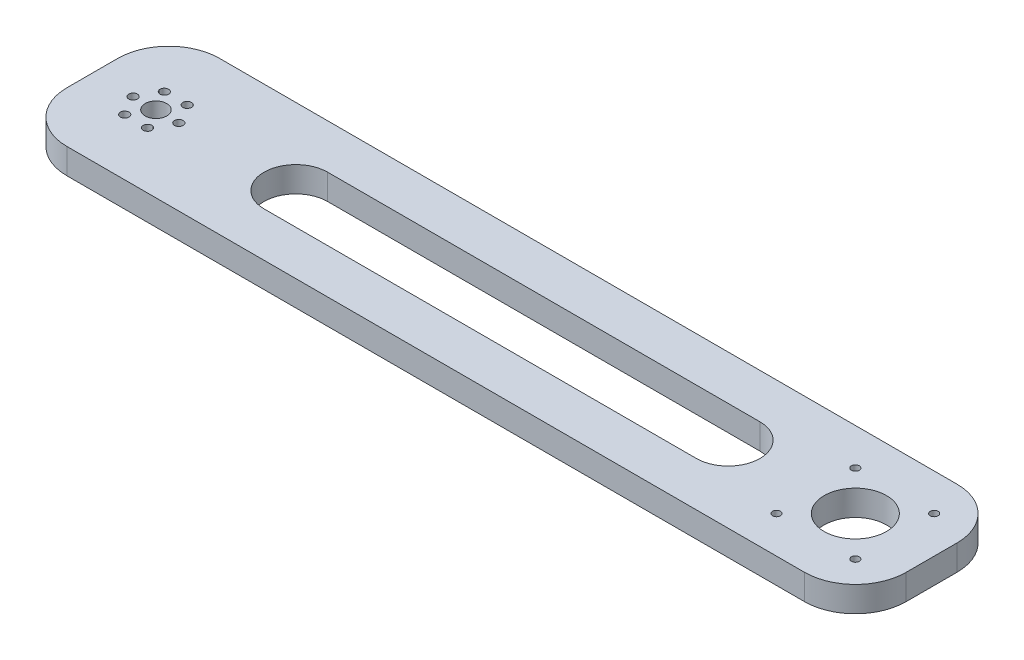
ISO-10303-21;
HEADER;
FILE_DESCRIPTION(('STEP AP214'),'2;1');
FILE_NAME('part.step','',(''),(''),'','','');
FILE_SCHEMA(('AUTOMOTIVE_DESIGN { 1 0 10303 214 1 1 1 1 }'));
ENDSEC;
DATA;
#1=APPLICATION_CONTEXT('core data for automotive mechanical design processes');
#2=APPLICATION_PROTOCOL_DEFINITION('international standard','automotive_design',2000,#1);
#3=PRODUCT_CONTEXT('',#1,'mechanical');
#4=PRODUCT('Part','Part','',(#3));
#5=PRODUCT_RELATED_PRODUCT_CATEGORY('part','',(#4));
#6=PRODUCT_DEFINITION_FORMATION('','',#4);
#7=PRODUCT_DEFINITION_CONTEXT('part definition',#1,'design');
#8=PRODUCT_DEFINITION('design','',#6,#7);
#9=PRODUCT_DEFINITION_SHAPE('','',#8);
#10=(LENGTH_UNIT() NAMED_UNIT(*) SI_UNIT(.MILLI.,.METRE.));
#11=(NAMED_UNIT(*) PLANE_ANGLE_UNIT() SI_UNIT($,.RADIAN.));
#12=(NAMED_UNIT(*) SI_UNIT($,.STERADIAN.) SOLID_ANGLE_UNIT());
#13=UNCERTAINTY_MEASURE_WITH_UNIT(LENGTH_MEASURE(1.E-05),#10,'distance_accuracy_value','');
#14=(GEOMETRIC_REPRESENTATION_CONTEXT(3) GLOBAL_UNCERTAINTY_ASSIGNED_CONTEXT((#13)) GLOBAL_UNIT_ASSIGNED_CONTEXT((#10,
#11,#12)) REPRESENTATION_CONTEXT('',''));
#15=CARTESIAN_POINT('',(0.,0.,0.));
#16=DIRECTION('',(0.,0.,1.));
#17=DIRECTION('',(1.,0.,0.));
#18=AXIS2_PLACEMENT_3D('',#15,#16,#17);
#19=CARTESIAN_POINT('',(165.,10.,30.));
#20=DIRECTION('',(-1.,0.,0.));
#21=DIRECTION('',(0.,0.,1.));
#22=AXIS2_PLACEMENT_3D('',#19,#20,#21);
#23=PLANE('',#22);
#24=DIRECTION('',(0.,0.,-1.));
#25=VECTOR('',#24,1.);
#26=CARTESIAN_POINT('',(165.,10.,30.));
#27=LINE('',#26,#25);
#28=CARTESIAN_POINT('',(165.,10.,9.99999999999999));
#29=VERTEX_POINT('',#28);
#30=CARTESIAN_POINT('',(165.,10.,-10.));
#31=VERTEX_POINT('',#30);
#32=EDGE_CURVE('E207',#29,#31,#27,.T.);
#33=ORIENTED_EDGE('',*,*,#32,.F.);
#34=DIRECTION('',(0.,-1.,0.));
#35=VECTOR('',#34,1.);
#36=CARTESIAN_POINT('',(165.,10.,9.99999999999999));
#37=LINE('',#36,#35);
#38=CARTESIAN_POINT('',(165.,0.,9.99999999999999));
#39=VERTEX_POINT('',#38);
#40=EDGE_CURVE('E235',#29,#39,#37,.T.);
#41=ORIENTED_EDGE('',*,*,#40,.T.);
#42=DIRECTION('',(0.,0.,-1.));
#43=VECTOR('',#42,1.);
#44=CARTESIAN_POINT('',(165.,0.,30.));
#45=LINE('',#44,#43);
#46=CARTESIAN_POINT('',(165.,0.,-10.));
#47=VERTEX_POINT('',#46);
#48=EDGE_CURVE('E218',#39,#47,#45,.T.);
#49=ORIENTED_EDGE('',*,*,#48,.T.);
#50=DIRECTION('',(0.,-1.,0.));
#51=VECTOR('',#50,1.);
#52=CARTESIAN_POINT('',(165.,10.,-10.));
#53=LINE('',#52,#51);
#54=EDGE_CURVE('E216',#47,#31,#53,.F.);
#55=ORIENTED_EDGE('',*,*,#54,.T.);
#56=EDGE_LOOP('',(#33,#41,#49,#55));
#57=FACE_BOUND('',#56,.T.);
#58=ADVANCED_FACE('F43',(#57),#23,.F.);
#59=CARTESIAN_POINT('',(-165.,10.,-30.));
#60=DIRECTION('',(0.,0.,1.));
#61=DIRECTION('',(1.,0.,0.));
#62=AXIS2_PLACEMENT_3D('',#59,#60,#61);
#63=PLANE('',#62);
#64=DIRECTION('',(-1.,0.,0.));
#65=VECTOR('',#64,1.);
#66=CARTESIAN_POINT('',(-165.,10.,-30.));
#67=LINE('',#66,#65);
#68=CARTESIAN_POINT('',(145.,10.,-30.));
#69=VERTEX_POINT('',#68);
#70=CARTESIAN_POINT('',(-145.,10.,-30.));
#71=VERTEX_POINT('',#70);
#72=EDGE_CURVE('E206',#69,#71,#67,.T.);
#73=ORIENTED_EDGE('',*,*,#72,.F.);
#74=DIRECTION('',(0.,-1.,0.));
#75=VECTOR('',#74,1.);
#76=CARTESIAN_POINT('',(145.,10.,-30.));
#77=LINE('',#76,#75);
#78=CARTESIAN_POINT('',(145.,0.,-30.));
#79=VERTEX_POINT('',#78);
#80=EDGE_CURVE('E256',#69,#79,#77,.T.);
#81=ORIENTED_EDGE('',*,*,#80,.T.);
#82=DIRECTION('',(-1.,0.,0.));
#83=VECTOR('',#82,1.);
#84=CARTESIAN_POINT('',(-165.,0.,-30.));
#85=LINE('',#84,#83);
#86=CARTESIAN_POINT('',(-145.,0.,-30.));
#87=VERTEX_POINT('',#86);
#88=EDGE_CURVE('E224',#79,#87,#85,.T.);
#89=ORIENTED_EDGE('',*,*,#88,.T.);
#90=DIRECTION('',(0.,-1.,0.));
#91=VECTOR('',#90,1.);
#92=CARTESIAN_POINT('',(-145.,10.,-30.));
#93=LINE('',#92,#91);
#94=EDGE_CURVE('E258',#87,#71,#93,.F.);
#95=ORIENTED_EDGE('',*,*,#94,.T.);
#96=EDGE_LOOP('',(#73,#81,#89,#95));
#97=FACE_BOUND('',#96,.T.);
#98=ADVANCED_FACE('F291',(#97),#63,.F.);
#99=CARTESIAN_POINT('',(-165.,10.,30.));
#100=DIRECTION('',(1.,0.,0.));
#101=DIRECTION('',(0.,0.,-1.));
#102=AXIS2_PLACEMENT_3D('',#99,#100,#101);
#103=PLANE('',#102);
#104=DIRECTION('',(0.,0.,1.));
#105=VECTOR('',#104,1.);
#106=CARTESIAN_POINT('',(-165.,10.,30.));
#107=LINE('',#106,#105);
#108=CARTESIAN_POINT('',(-165.,10.,-10.));
#109=VERTEX_POINT('',#108);
#110=CARTESIAN_POINT('',(-165.,10.,9.99999999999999));
#111=VERTEX_POINT('',#110);
#112=EDGE_CURVE('E214',#109,#111,#107,.T.);
#113=ORIENTED_EDGE('',*,*,#112,.F.);
#114=DIRECTION('',(0.,-1.,0.));
#115=VECTOR('',#114,1.);
#116=CARTESIAN_POINT('',(-165.,10.,-10.));
#117=LINE('',#116,#115);
#118=CARTESIAN_POINT('',(-165.,0.,-10.));
#119=VERTEX_POINT('',#118);
#120=EDGE_CURVE('E11',#109,#119,#117,.T.);
#121=ORIENTED_EDGE('',*,*,#120,.T.);
#122=DIRECTION('',(0.,0.,1.));
#123=VECTOR('',#122,1.);
#124=CARTESIAN_POINT('',(-165.,0.,30.));
#125=LINE('',#124,#123);
#126=CARTESIAN_POINT('',(-165.,0.,9.99999999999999));
#127=VERTEX_POINT('',#126);
#128=EDGE_CURVE('E229',#119,#127,#125,.T.);
#129=ORIENTED_EDGE('',*,*,#128,.T.);
#130=DIRECTION('',(0.,-1.,0.));
#131=VECTOR('',#130,1.);
#132=CARTESIAN_POINT('',(-165.,10.,9.99999999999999));
#133=LINE('',#132,#131);
#134=EDGE_CURVE('E55',#127,#111,#133,.F.);
#135=ORIENTED_EDGE('',*,*,#134,.T.);
#136=EDGE_LOOP('',(#113,#121,#129,#135));
#137=FACE_BOUND('',#136,.T.);
#138=ADVANCED_FACE('F264',(#137),#103,.F.);
#139=CARTESIAN_POINT('',(-165.,10.,30.));
#140=DIRECTION('',(0.,0.,-1.));
#141=DIRECTION('',(-1.,0.,0.));
#142=AXIS2_PLACEMENT_3D('',#139,#140,#141);
#143=PLANE('',#142);
#144=DIRECTION('',(1.,0.,0.));
#145=VECTOR('',#144,1.);
#146=CARTESIAN_POINT('',(-165.,0.,30.));
#147=LINE('',#146,#145);
#148=CARTESIAN_POINT('',(-145.,0.,30.));
#149=VERTEX_POINT('',#148);
#150=CARTESIAN_POINT('',(145.,0.,30.));
#151=VERTEX_POINT('',#150);
#152=EDGE_CURVE('E208',#149,#151,#147,.T.);
#153=ORIENTED_EDGE('',*,*,#152,.T.);
#154=DIRECTION('',(0.,-1.,0.));
#155=VECTOR('',#154,1.);
#156=CARTESIAN_POINT('',(145.,10.,30.));
#157=LINE('',#156,#155);
#158=CARTESIAN_POINT('',(145.,10.,30.));
#159=VERTEX_POINT('',#158);
#160=EDGE_CURVE('E246',#151,#159,#157,.F.);
#161=ORIENTED_EDGE('',*,*,#160,.T.);
#162=DIRECTION('',(1.,0.,0.));
#163=VECTOR('',#162,1.);
#164=CARTESIAN_POINT('',(-165.,10.,30.));
#165=LINE('',#164,#163);
#166=CARTESIAN_POINT('',(-145.,10.,30.));
#167=VERTEX_POINT('',#166);
#168=EDGE_CURVE('E217',#167,#159,#165,.T.);
#169=ORIENTED_EDGE('',*,*,#168,.F.);
#170=DIRECTION('',(0.,-1.,0.));
#171=VECTOR('',#170,1.);
#172=CARTESIAN_POINT('',(-145.,10.,30.));
#173=LINE('',#172,#171);
#174=EDGE_CURVE('E244',#167,#149,#173,.T.);
#175=ORIENTED_EDGE('',*,*,#174,.T.);
#176=EDGE_LOOP('',(#153,#161,#169,#175));
#177=FACE_BOUND('',#176,.T.);
#178=ADVANCED_FACE('F274',(#177),#143,.F.);
#179=CARTESIAN_POINT('',(0.,10.,0.));
#180=DIRECTION('',(0.,-1.,0.));
#181=DIRECTION('',(0.,0.,-1.));
#182=AXIS2_PLACEMENT_3D('',#179,#180,#181);
#183=PLANE('',#182);
#184=CARTESIAN_POINT('',(-144.5,10.,7.7942286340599));
#185=DIRECTION('',(0.,-1.,0.));
#186=DIRECTION('',(-0.866025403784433,0.,-0.50000000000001));
#187=AXIS2_PLACEMENT_3D('',#184,#185,#186);
#188=CIRCLE('',#187,1.70000000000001);
#189=CARTESIAN_POINT('',(-145.972243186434,10.,6.94422863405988));
#190=VERTEX_POINT('',#189);
#191=EDGE_CURVE('E542',#190,#190,#188,.T.);
#192=ORIENTED_EDGE('',*,*,#191,.T.);
#193=EDGE_LOOP('',(#192));
#194=FACE_BOUND('',#193,.T.);
#195=CARTESIAN_POINT('',(-135.5,10.,7.79422863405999));
#196=DIRECTION('',(0.,-1.,0.));
#197=DIRECTION('',(-0.866025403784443,0.,0.499999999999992));
#198=AXIS2_PLACEMENT_3D('',#195,#196,#197);
#199=CIRCLE('',#198,1.70000000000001);
#200=CARTESIAN_POINT('',(-136.972243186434,10.,8.64422863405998));
#201=VERTEX_POINT('',#200);
#202=EDGE_CURVE('E601',#201,#201,#199,.T.);
#203=ORIENTED_EDGE('',*,*,#202,.T.);
#204=EDGE_LOOP('',(#203));
#205=FACE_BOUND('',#204,.T.);
#206=CARTESIAN_POINT('',(-131.,10.,0.));
#207=DIRECTION('',(0.,-1.,0.));
#208=DIRECTION('',(0.,0.,1.));
#209=AXIS2_PLACEMENT_3D('',#206,#207,#208);
#210=CIRCLE('',#209,1.70000000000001);
#211=CARTESIAN_POINT('',(-131.,10.,1.70000000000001));
#212=VERTEX_POINT('',#211);
#213=EDGE_CURVE('E591',#212,#212,#210,.T.);
#214=ORIENTED_EDGE('',*,*,#213,.T.);
#215=EDGE_LOOP('',(#214));
#216=FACE_BOUND('',#215,.T.);
#217=CARTESIAN_POINT('',(-135.5,10.,-7.79422863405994));
#218=DIRECTION('',(0.,-1.,0.));
#219=DIRECTION('',(0.866025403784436,0.,0.500000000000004));
#220=AXIS2_PLACEMENT_3D('',#217,#218,#219);
#221=CIRCLE('',#220,1.70000000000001);
#222=CARTESIAN_POINT('',(-134.027756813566,10.,-6.94422863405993));
#223=VERTEX_POINT('',#222);
#224=EDGE_CURVE('E553',#223,#223,#221,.T.);
#225=ORIENTED_EDGE('',*,*,#224,.T.);
#226=EDGE_LOOP('',(#225));
#227=FACE_BOUND('',#226,.T.);
#228=CARTESIAN_POINT('',(-144.5,10.,-7.79422863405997));
#229=DIRECTION('',(0.,-1.,0.));
#230=DIRECTION('',(0.86602540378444,0.,-0.499999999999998));
#231=AXIS2_PLACEMENT_3D('',#228,#229,#230);
#232=CIRCLE('',#231,1.70000000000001);
#233=CARTESIAN_POINT('',(-143.027756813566,10.,-8.64422863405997));
#234=VERTEX_POINT('',#233);
#235=EDGE_CURVE('E548',#234,#234,#232,.T.);
#236=ORIENTED_EDGE('',*,*,#235,.T.);
#237=EDGE_LOOP('',(#236));
#238=FACE_BOUND('',#237,.T.);
#239=CARTESIAN_POINT('',(-149.,10.,0.));
#240=DIRECTION('',(0.,-1.,0.));
#241=DIRECTION('',(0.,0.,-1.));
#242=AXIS2_PLACEMENT_3D('',#239,#240,#241);
#243=CIRCLE('',#242,1.70000000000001);
#244=CARTESIAN_POINT('',(-149.,10.,-1.70000000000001));
#245=VERTEX_POINT('',#244);
#246=EDGE_CURVE('E161',#245,#245,#243,.T.);
#247=ORIENTED_EDGE('',*,*,#246,.T.);
#248=EDGE_LOOP('',(#247));
#249=FACE_BOUND('',#248,.T.);
#250=DIRECTION('',(-1.,0.,0.));
#251=VECTOR('',#250,1.);
#252=CARTESIAN_POINT('',(-85.,10.,12.5));
#253=LINE('',#252,#251);
#254=CARTESIAN_POINT('',(85.,10.,12.5));
#255=VERTEX_POINT('',#254);
#256=CARTESIAN_POINT('',(-85.,10.,12.5));
#257=VERTEX_POINT('',#256);
#258=EDGE_CURVE('E142',#255,#257,#253,.T.);
#259=ORIENTED_EDGE('',*,*,#258,.T.);
#260=CARTESIAN_POINT('',(-85.,10.,0.));
#261=DIRECTION('',(0.,-1.,0.));
#262=DIRECTION('',(0.,0.,-1.));
#263=AXIS2_PLACEMENT_3D('',#260,#261,#262);
#264=CIRCLE('',#263,12.5);
#265=CARTESIAN_POINT('',(-85.,10.,-12.5));
#266=VERTEX_POINT('',#265);
#267=EDGE_CURVE('E133',#257,#266,#264,.T.);
#268=ORIENTED_EDGE('',*,*,#267,.T.);
#269=DIRECTION('',(1.,0.,0.));
#270=VECTOR('',#269,1.);
#271=CARTESIAN_POINT('',(-85.,10.,-12.5));
#272=LINE('',#271,#270);
#273=CARTESIAN_POINT('',(85.,10.,-12.5));
#274=VERTEX_POINT('',#273);
#275=EDGE_CURVE('E141',#266,#274,#272,.T.);
#276=ORIENTED_EDGE('',*,*,#275,.T.);
#277=CARTESIAN_POINT('',(85.,10.,0.));
#278=DIRECTION('',(0.,-1.,0.));
#279=DIRECTION('',(0.,0.,-1.));
#280=AXIS2_PLACEMENT_3D('',#277,#278,#279);
#281=CIRCLE('',#280,12.5);
#282=EDGE_CURVE('E56',#274,#255,#281,.T.);
#283=ORIENTED_EDGE('',*,*,#282,.T.);
#284=EDGE_LOOP('',(#259,#268,#276,#283));
#285=FACE_BOUND('',#284,.T.);
#286=CARTESIAN_POINT('',(-140.,10.,0.));
#287=DIRECTION('',(0.,-1.,0.));
#288=DIRECTION('',(0.,0.,-1.));
#289=AXIS2_PLACEMENT_3D('',#286,#287,#288);
#290=CIRCLE('',#289,4.25000000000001);
#291=CARTESIAN_POINT('',(-140.,10.,-4.25000000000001));
#292=VERTEX_POINT('',#291);
#293=EDGE_CURVE('E173',#292,#292,#290,.T.);
#294=ORIENTED_EDGE('',*,*,#293,.T.);
#295=EDGE_LOOP('',(#294));
#296=FACE_BOUND('',#295,.T.);
#297=CARTESIAN_POINT('',(119.5,10.,-15.5));
#298=DIRECTION('',(0.,-1.,0.));
#299=DIRECTION('',(0.,0.,-1.));
#300=AXIS2_PLACEMENT_3D('',#297,#298,#299);
#301=CIRCLE('',#300,1.54999999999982);
#302=CARTESIAN_POINT('',(119.5,10.,-17.0499999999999));
#303=VERTEX_POINT('',#302);
#304=EDGE_CURVE('E176',#303,#303,#301,.T.);
#305=ORIENTED_EDGE('',*,*,#304,.T.);
#306=EDGE_LOOP('',(#305));
#307=FACE_BOUND('',#306,.T.);
#308=CARTESIAN_POINT('',(150.5,10.,-15.5));
#309=DIRECTION('',(0.,-1.,0.));
#310=DIRECTION('',(0.,0.,-1.));
#311=AXIS2_PLACEMENT_3D('',#308,#309,#310);
#312=CIRCLE('',#311,1.54999999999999);
#313=CARTESIAN_POINT('',(150.5,10.,-17.05));
#314=VERTEX_POINT('',#313);
#315=EDGE_CURVE('E187',#314,#314,#312,.T.);
#316=ORIENTED_EDGE('',*,*,#315,.T.);
#317=EDGE_LOOP('',(#316));
#318=FACE_BOUND('',#317,.T.);
#319=CARTESIAN_POINT('',(150.5,10.,15.5));
#320=DIRECTION('',(0.,-1.,0.));
#321=DIRECTION('',(0.,0.,-1.));
#322=AXIS2_PLACEMENT_3D('',#319,#320,#321);
#323=CIRCLE('',#322,1.54999999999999);
#324=CARTESIAN_POINT('',(150.5,10.,13.95));
#325=VERTEX_POINT('',#324);
#326=EDGE_CURVE('E185',#325,#325,#323,.T.);
#327=ORIENTED_EDGE('',*,*,#326,.T.);
#328=EDGE_LOOP('',(#327));
#329=FACE_BOUND('',#328,.T.);
#330=CARTESIAN_POINT('',(119.5,10.,15.5));
#331=DIRECTION('',(0.,-1.,0.));
#332=DIRECTION('',(0.,0.,-1.));
#333=AXIS2_PLACEMENT_3D('',#330,#331,#332);
#334=CIRCLE('',#333,1.54999999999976);
#335=CARTESIAN_POINT('',(119.5,10.,13.9500000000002));
#336=VERTEX_POINT('',#335);
#337=EDGE_CURVE('E198',#336,#336,#334,.T.);
#338=ORIENTED_EDGE('',*,*,#337,.T.);
#339=EDGE_LOOP('',(#338));
#340=FACE_BOUND('',#339,.T.);
#341=CARTESIAN_POINT('',(135.,10.,0.));
#342=DIRECTION('',(0.,1.,0.));
#343=DIRECTION('',(0.,0.,1.));
#344=AXIS2_PLACEMENT_3D('',#341,#342,#343);
#345=CIRCLE('',#344,12.25);
#346=CARTESIAN_POINT('',(135.,10.,12.25));
#347=VERTEX_POINT('',#346);
#348=EDGE_CURVE('E201',#347,#347,#345,.T.);
#349=ORIENTED_EDGE('',*,*,#348,.F.);
#350=EDGE_LOOP('',(#349));
#351=FACE_BOUND('',#350,.T.);
#352=ORIENTED_EDGE('',*,*,#168,.T.);
#353=CARTESIAN_POINT('',(145.,10.,9.99999999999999));
#354=DIRECTION('',(0.,-1.,0.));
#355=DIRECTION('',(0.,0.,-1.));
#356=AXIS2_PLACEMENT_3D('',#353,#354,#355);
#357=CIRCLE('',#356,20.);
#358=EDGE_CURVE('E253',#159,#29,#357,.F.);
#359=ORIENTED_EDGE('',*,*,#358,.T.);
#360=ORIENTED_EDGE('',*,*,#32,.T.);
#361=CARTESIAN_POINT('',(145.,10.,-10.));
#362=DIRECTION('',(0.,-1.,0.));
#363=DIRECTION('',(0.,0.,-1.));
#364=AXIS2_PLACEMENT_3D('',#361,#362,#363);
#365=CIRCLE('',#364,20.);
#366=EDGE_CURVE('E251',#31,#69,#365,.F.);
#367=ORIENTED_EDGE('',*,*,#366,.T.);
#368=ORIENTED_EDGE('',*,*,#72,.T.);
#369=CARTESIAN_POINT('',(-145.,10.,-10.));
#370=DIRECTION('',(0.,-1.,0.));
#371=DIRECTION('',(0.,0.,-1.));
#372=AXIS2_PLACEMENT_3D('',#369,#370,#371);
#373=CIRCLE('',#372,20.);
#374=EDGE_CURVE('E250',#71,#109,#373,.F.);
#375=ORIENTED_EDGE('',*,*,#374,.T.);
#376=ORIENTED_EDGE('',*,*,#112,.T.);
#377=CARTESIAN_POINT('',(-145.,10.,9.99999999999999));
#378=DIRECTION('',(0.,-1.,0.));
#379=DIRECTION('',(0.,0.,-1.));
#380=AXIS2_PLACEMENT_3D('',#377,#378,#379);
#381=CIRCLE('',#380,20.);
#382=EDGE_CURVE('E249',#111,#167,#381,.F.);
#383=ORIENTED_EDGE('',*,*,#382,.T.);
#384=EDGE_LOOP('',(#352,#359,#360,#367,#368,#375,#376,#383));
#385=FACE_BOUND('',#384,.T.);
#386=ADVANCED_FACE('F149',(#194,#205,#216,#227,#238,#249,#285,#296,#307,#318,#329,#340,#351,
#385),#183,.F.);
#387=CARTESIAN_POINT('',(0.,0.,0.));
#388=DIRECTION('',(0.,-1.,0.));
#389=DIRECTION('',(0.,0.,-1.));
#390=AXIS2_PLACEMENT_3D('',#387,#388,#389);
#391=PLANE('',#390);
#392=CARTESIAN_POINT('',(-144.5,0.,7.7942286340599));
#393=DIRECTION('',(0.,-1.,0.));
#394=DIRECTION('',(-0.866025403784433,0.,-0.50000000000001));
#395=AXIS2_PLACEMENT_3D('',#392,#393,#394);
#396=CIRCLE('',#395,1.70000000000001);
#397=CARTESIAN_POINT('',(-145.972243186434,0.,6.94422863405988));
#398=VERTEX_POINT('',#397);
#399=EDGE_CURVE('E544',#398,#398,#396,.T.);
#400=ORIENTED_EDGE('',*,*,#399,.F.);
#401=EDGE_LOOP('',(#400));
#402=FACE_BOUND('',#401,.T.);
#403=CARTESIAN_POINT('',(-135.5,0.,7.79422863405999));
#404=DIRECTION('',(0.,-1.,0.));
#405=DIRECTION('',(-0.866025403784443,0.,0.499999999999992));
#406=AXIS2_PLACEMENT_3D('',#403,#404,#405);
#407=CIRCLE('',#406,1.70000000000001);
#408=CARTESIAN_POINT('',(-136.972243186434,0.,8.64422863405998));
#409=VERTEX_POINT('',#408);
#410=EDGE_CURVE('E543',#409,#409,#407,.T.);
#411=ORIENTED_EDGE('',*,*,#410,.F.);
#412=EDGE_LOOP('',(#411));
#413=FACE_BOUND('',#412,.T.);
#414=CARTESIAN_POINT('',(-131.,0.,0.));
#415=DIRECTION('',(0.,-1.,0.));
#416=DIRECTION('',(0.,0.,1.));
#417=AXIS2_PLACEMENT_3D('',#414,#415,#416);
#418=CIRCLE('',#417,1.70000000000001);
#419=CARTESIAN_POINT('',(-131.,0.,1.70000000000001));
#420=VERTEX_POINT('',#419);
#421=EDGE_CURVE('E598',#420,#420,#418,.T.);
#422=ORIENTED_EDGE('',*,*,#421,.F.);
#423=EDGE_LOOP('',(#422));
#424=FACE_BOUND('',#423,.T.);
#425=CARTESIAN_POINT('',(-135.5,0.,-7.79422863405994));
#426=DIRECTION('',(0.,-1.,0.));
#427=DIRECTION('',(0.866025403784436,0.,0.500000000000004));
#428=AXIS2_PLACEMENT_3D('',#425,#426,#427);
#429=CIRCLE('',#428,1.70000000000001);
#430=CARTESIAN_POINT('',(-134.027756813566,0.,-6.94422863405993));
#431=VERTEX_POINT('',#430);
#432=EDGE_CURVE('E586',#431,#431,#429,.T.);
#433=ORIENTED_EDGE('',*,*,#432,.F.);
#434=EDGE_LOOP('',(#433));
#435=FACE_BOUND('',#434,.T.);
#436=CARTESIAN_POINT('',(-144.5,0.,-7.79422863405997));
#437=DIRECTION('',(0.,-1.,0.));
#438=DIRECTION('',(0.86602540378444,0.,-0.499999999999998));
#439=AXIS2_PLACEMENT_3D('',#436,#437,#438);
#440=CIRCLE('',#439,1.70000000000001);
#441=CARTESIAN_POINT('',(-143.027756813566,0.,-8.64422863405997));
#442=VERTEX_POINT('',#441);
#443=EDGE_CURVE('E551',#442,#442,#440,.T.);
#444=ORIENTED_EDGE('',*,*,#443,.F.);
#445=EDGE_LOOP('',(#444));
#446=FACE_BOUND('',#445,.T.);
#447=CARTESIAN_POINT('',(-149.,0.,0.));
#448=DIRECTION('',(0.,-1.,0.));
#449=DIRECTION('',(0.,0.,-1.));
#450=AXIS2_PLACEMENT_3D('',#447,#448,#449);
#451=CIRCLE('',#450,1.70000000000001);
#452=CARTESIAN_POINT('',(-149.,0.,-1.70000000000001));
#453=VERTEX_POINT('',#452);
#454=EDGE_CURVE('E160',#453,#453,#451,.T.);
#455=ORIENTED_EDGE('',*,*,#454,.F.);
#456=EDGE_LOOP('',(#455));
#457=FACE_BOUND('',#456,.T.);
#458=CARTESIAN_POINT('',(-85.,0.,0.));
#459=DIRECTION('',(0.,-1.,0.));
#460=DIRECTION('',(0.,0.,-1.));
#461=AXIS2_PLACEMENT_3D('',#458,#459,#460);
#462=CIRCLE('',#461,12.5);
#463=CARTESIAN_POINT('',(-85.,0.,12.5));
#464=VERTEX_POINT('',#463);
#465=CARTESIAN_POINT('',(-85.,0.,-12.5));
#466=VERTEX_POINT('',#465);
#467=EDGE_CURVE('E70',#464,#466,#462,.T.);
#468=ORIENTED_EDGE('',*,*,#467,.F.);
#469=DIRECTION('',(-1.,0.,0.));
#470=VECTOR('',#469,1.);
#471=CARTESIAN_POINT('',(-85.,0.,12.5));
#472=LINE('',#471,#470);
#473=CARTESIAN_POINT('',(85.,0.,12.5));
#474=VERTEX_POINT('',#473);
#475=EDGE_CURVE('E154',#474,#464,#472,.T.);
#476=ORIENTED_EDGE('',*,*,#475,.F.);
#477=CARTESIAN_POINT('',(85.,0.,0.));
#478=DIRECTION('',(0.,-1.,0.));
#479=DIRECTION('',(0.,0.,-1.));
#480=AXIS2_PLACEMENT_3D('',#477,#478,#479);
#481=CIRCLE('',#480,12.5);
#482=CARTESIAN_POINT('',(85.,0.,-12.5));
#483=VERTEX_POINT('',#482);
#484=EDGE_CURVE('E153',#483,#474,#481,.T.);
#485=ORIENTED_EDGE('',*,*,#484,.F.);
#486=DIRECTION('',(1.,0.,0.));
#487=VECTOR('',#486,1.);
#488=CARTESIAN_POINT('',(-85.,0.,-12.5));
#489=LINE('',#488,#487);
#490=EDGE_CURVE('E164',#466,#483,#489,.T.);
#491=ORIENTED_EDGE('',*,*,#490,.F.);
#492=EDGE_LOOP('',(#468,#476,#485,#491));
#493=FACE_BOUND('',#492,.T.);
#494=CARTESIAN_POINT('',(-140.,0.,0.));
#495=DIRECTION('',(0.,-1.,0.));
#496=DIRECTION('',(0.,0.,-1.));
#497=AXIS2_PLACEMENT_3D('',#494,#495,#496);
#498=CIRCLE('',#497,4.25000000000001);
#499=CARTESIAN_POINT('',(-140.,0.,-4.25000000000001));
#500=VERTEX_POINT('',#499);
#501=EDGE_CURVE('E168',#500,#500,#498,.T.);
#502=ORIENTED_EDGE('',*,*,#501,.F.);
#503=EDGE_LOOP('',(#502));
#504=FACE_BOUND('',#503,.T.);
#505=CARTESIAN_POINT('',(119.5,0.,-15.5));
#506=DIRECTION('',(0.,-1.,0.));
#507=DIRECTION('',(0.,0.,-1.));
#508=AXIS2_PLACEMENT_3D('',#505,#506,#507);
#509=CIRCLE('',#508,1.54999999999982);
#510=CARTESIAN_POINT('',(119.5,0.,-17.0499999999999));
#511=VERTEX_POINT('',#510);
#512=EDGE_CURVE('E193',#511,#511,#509,.T.);
#513=ORIENTED_EDGE('',*,*,#512,.F.);
#514=EDGE_LOOP('',(#513));
#515=FACE_BOUND('',#514,.T.);
#516=CARTESIAN_POINT('',(150.5,0.,-15.5));
#517=DIRECTION('',(0.,-1.,0.));
#518=DIRECTION('',(0.,0.,-1.));
#519=AXIS2_PLACEMENT_3D('',#516,#517,#518);
#520=CIRCLE('',#519,1.54999999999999);
#521=CARTESIAN_POINT('',(150.5,0.,-17.05));
#522=VERTEX_POINT('',#521);
#523=EDGE_CURVE('E190',#522,#522,#520,.T.);
#524=ORIENTED_EDGE('',*,*,#523,.F.);
#525=EDGE_LOOP('',(#524));
#526=FACE_BOUND('',#525,.T.);
#527=CARTESIAN_POINT('',(150.5,0.,15.5));
#528=DIRECTION('',(0.,-1.,0.));
#529=DIRECTION('',(0.,0.,-1.));
#530=AXIS2_PLACEMENT_3D('',#527,#528,#529);
#531=CIRCLE('',#530,1.54999999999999);
#532=CARTESIAN_POINT('',(150.5,0.,13.95));
#533=VERTEX_POINT('',#532);
#534=EDGE_CURVE('E177',#533,#533,#531,.T.);
#535=ORIENTED_EDGE('',*,*,#534,.F.);
#536=EDGE_LOOP('',(#535));
#537=FACE_BOUND('',#536,.T.);
#538=CARTESIAN_POINT('',(119.5,0.,15.5));
#539=DIRECTION('',(0.,-1.,0.));
#540=DIRECTION('',(0.,0.,-1.));
#541=AXIS2_PLACEMENT_3D('',#538,#539,#540);
#542=CIRCLE('',#541,1.54999999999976);
#543=CARTESIAN_POINT('',(119.5,0.,13.9500000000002));
#544=VERTEX_POINT('',#543);
#545=EDGE_CURVE('E181',#544,#544,#542,.T.);
#546=ORIENTED_EDGE('',*,*,#545,.F.);
#547=EDGE_LOOP('',(#546));
#548=FACE_BOUND('',#547,.T.);
#549=CARTESIAN_POINT('',(135.,0.,0.));
#550=DIRECTION('',(0.,-1.,0.));
#551=DIRECTION('',(0.,0.,-1.));
#552=AXIS2_PLACEMENT_3D('',#549,#550,#551);
#553=CIRCLE('',#552,12.25);
#554=CARTESIAN_POINT('',(135.,0.,-12.25));
#555=VERTEX_POINT('',#554);
#556=EDGE_CURVE('E50',#555,#555,#553,.T.);
#557=ORIENTED_EDGE('',*,*,#556,.F.);
#558=EDGE_LOOP('',(#557));
#559=FACE_BOUND('',#558,.T.);
#560=ORIENTED_EDGE('',*,*,#48,.F.);
#561=CARTESIAN_POINT('',(145.,0.,9.99999999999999));
#562=DIRECTION('',(0.,-1.,0.));
#563=DIRECTION('',(0.,0.,-1.));
#564=AXIS2_PLACEMENT_3D('',#561,#562,#563);
#565=CIRCLE('',#564,20.);
#566=EDGE_CURVE('E242',#39,#151,#565,.T.);
#567=ORIENTED_EDGE('',*,*,#566,.T.);
#568=ORIENTED_EDGE('',*,*,#152,.F.);
#569=CARTESIAN_POINT('',(-145.,0.,9.99999999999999));
#570=DIRECTION('',(0.,-1.,0.));
#571=DIRECTION('',(0.,0.,-1.));
#572=AXIS2_PLACEMENT_3D('',#569,#570,#571);
#573=CIRCLE('',#572,20.);
#574=EDGE_CURVE('E233',#149,#127,#573,.T.);
#575=ORIENTED_EDGE('',*,*,#574,.T.);
#576=ORIENTED_EDGE('',*,*,#128,.F.);
#577=CARTESIAN_POINT('',(-145.,0.,-10.));
#578=DIRECTION('',(0.,-1.,0.));
#579=DIRECTION('',(0.,0.,-1.));
#580=AXIS2_PLACEMENT_3D('',#577,#578,#579);
#581=CIRCLE('',#580,20.);
#582=EDGE_CURVE('E240',#119,#87,#581,.T.);
#583=ORIENTED_EDGE('',*,*,#582,.T.);
#584=ORIENTED_EDGE('',*,*,#88,.F.);
#585=CARTESIAN_POINT('',(145.,0.,-10.));
#586=DIRECTION('',(0.,-1.,0.));
#587=DIRECTION('',(0.,0.,-1.));
#588=AXIS2_PLACEMENT_3D('',#585,#586,#587);
#589=CIRCLE('',#588,20.);
#590=EDGE_CURVE('E236',#79,#47,#589,.T.);
#591=ORIENTED_EDGE('',*,*,#590,.T.);
#592=EDGE_LOOP('',(#560,#567,#568,#575,#576,#583,#584,#591));
#593=FACE_BOUND('',#592,.T.);
#594=ADVANCED_FACE('F278',(#402,#413,#424,#435,#446,#457,#493,#504,#515,#526,#537,#548,#559,
#593),#391,.T.);
#595=CARTESIAN_POINT('',(145.,10.,9.99999999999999));
#596=DIRECTION('',(0.,-1.,0.));
#597=DIRECTION('',(0.,0.,-1.));
#598=AXIS2_PLACEMENT_3D('',#595,#596,#597);
#599=CYLINDRICAL_SURFACE('',#598,20.);
#600=ORIENTED_EDGE('',*,*,#358,.F.);
#601=ORIENTED_EDGE('',*,*,#160,.F.);
#602=ORIENTED_EDGE('',*,*,#566,.F.);
#603=ORIENTED_EDGE('',*,*,#40,.F.);
#604=EDGE_LOOP('',(#600,#601,#602,#603));
#605=FACE_BOUND('',#604,.T.);
#606=ADVANCED_FACE('F284',(#605),#599,.T.);
#607=CARTESIAN_POINT('',(145.,10.,-10.));
#608=DIRECTION('',(0.,-1.,0.));
#609=DIRECTION('',(0.,0.,-1.));
#610=AXIS2_PLACEMENT_3D('',#607,#608,#609);
#611=CYLINDRICAL_SURFACE('',#610,20.);
#612=ORIENTED_EDGE('',*,*,#366,.F.);
#613=ORIENTED_EDGE('',*,*,#54,.F.);
#614=ORIENTED_EDGE('',*,*,#590,.F.);
#615=ORIENTED_EDGE('',*,*,#80,.F.);
#616=EDGE_LOOP('',(#612,#613,#614,#615));
#617=FACE_BOUND('',#616,.T.);
#618=ADVANCED_FACE('F292',(#617),#611,.T.);
#619=CARTESIAN_POINT('',(-145.,10.,-10.));
#620=DIRECTION('',(0.,-1.,0.));
#621=DIRECTION('',(0.,0.,-1.));
#622=AXIS2_PLACEMENT_3D('',#619,#620,#621);
#623=CYLINDRICAL_SURFACE('',#622,20.);
#624=ORIENTED_EDGE('',*,*,#374,.F.);
#625=ORIENTED_EDGE('',*,*,#94,.F.);
#626=ORIENTED_EDGE('',*,*,#582,.F.);
#627=ORIENTED_EDGE('',*,*,#120,.F.);
#628=EDGE_LOOP('',(#624,#625,#626,#627));
#629=FACE_BOUND('',#628,.T.);
#630=ADVANCED_FACE('F297',(#629),#623,.T.);
#631=CARTESIAN_POINT('',(-145.,10.,9.99999999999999));
#632=DIRECTION('',(0.,-1.,0.));
#633=DIRECTION('',(0.,0.,-1.));
#634=AXIS2_PLACEMENT_3D('',#631,#632,#633);
#635=CYLINDRICAL_SURFACE('',#634,20.);
#636=ORIENTED_EDGE('',*,*,#382,.F.);
#637=ORIENTED_EDGE('',*,*,#134,.F.);
#638=ORIENTED_EDGE('',*,*,#574,.F.);
#639=ORIENTED_EDGE('',*,*,#174,.F.);
#640=EDGE_LOOP('',(#636,#637,#638,#639));
#641=FACE_BOUND('',#640,.T.);
#642=ADVANCED_FACE('F44',(#641),#635,.T.);
#643=CARTESIAN_POINT('',(135.,-2.,0.));
#644=DIRECTION('',(0.,1.,0.));
#645=DIRECTION('',(0.,0.,1.));
#646=AXIS2_PLACEMENT_3D('',#643,#644,#645);
#647=CYLINDRICAL_SURFACE('',#646,12.25);
#648=ORIENTED_EDGE('',*,*,#556,.T.);
#649=EDGE_LOOP('',(#648));
#650=FACE_BOUND('',#649,.T.);
#651=ORIENTED_EDGE('',*,*,#348,.T.);
#652=EDGE_LOOP('',(#651));
#653=FACE_BOUND('',#652,.T.);
#654=ADVANCED_FACE('F305',(#650,#653),#647,.F.);
#655=CARTESIAN_POINT('',(119.5,10.,15.5));
#656=DIRECTION('',(0.,-1.,0.));
#657=DIRECTION('',(0.,0.,-1.));
#658=AXIS2_PLACEMENT_3D('',#655,#656,#657);
#659=CYLINDRICAL_SURFACE('',#658,1.54999999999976);
#660=ORIENTED_EDGE('',*,*,#337,.F.);
#661=EDGE_LOOP('',(#660));
#662=FACE_BOUND('',#661,.T.);
#663=ORIENTED_EDGE('',*,*,#545,.T.);
#664=EDGE_LOOP('',(#663));
#665=FACE_BOUND('',#664,.T.);
#666=ADVANCED_FACE('F382',(#662,#665),#659,.F.);
#667=CARTESIAN_POINT('',(150.5,10.,15.5));
#668=DIRECTION('',(0.,-1.,0.));
#669=DIRECTION('',(0.,0.,-1.));
#670=AXIS2_PLACEMENT_3D('',#667,#668,#669);
#671=CYLINDRICAL_SURFACE('',#670,1.54999999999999);
#672=ORIENTED_EDGE('',*,*,#326,.F.);
#673=EDGE_LOOP('',(#672));
#674=FACE_BOUND('',#673,.T.);
#675=ORIENTED_EDGE('',*,*,#534,.T.);
#676=EDGE_LOOP('',(#675));
#677=FACE_BOUND('',#676,.T.);
#678=ADVANCED_FACE('F388',(#674,#677),#671,.F.);
#679=CARTESIAN_POINT('',(150.5,10.,-15.5));
#680=DIRECTION('',(0.,-1.,0.));
#681=DIRECTION('',(0.,0.,-1.));
#682=AXIS2_PLACEMENT_3D('',#679,#680,#681);
#683=CYLINDRICAL_SURFACE('',#682,1.54999999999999);
#684=ORIENTED_EDGE('',*,*,#315,.F.);
#685=EDGE_LOOP('',(#684));
#686=FACE_BOUND('',#685,.T.);
#687=ORIENTED_EDGE('',*,*,#523,.T.);
#688=EDGE_LOOP('',(#687));
#689=FACE_BOUND('',#688,.T.);
#690=ADVANCED_FACE('F400',(#686,#689),#683,.F.);
#691=CARTESIAN_POINT('',(119.5,10.,-15.5));
#692=DIRECTION('',(0.,-1.,0.));
#693=DIRECTION('',(0.,0.,-1.));
#694=AXIS2_PLACEMENT_3D('',#691,#692,#693);
#695=CYLINDRICAL_SURFACE('',#694,1.54999999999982);
#696=ORIENTED_EDGE('',*,*,#304,.F.);
#697=EDGE_LOOP('',(#696));
#698=FACE_BOUND('',#697,.T.);
#699=ORIENTED_EDGE('',*,*,#512,.T.);
#700=EDGE_LOOP('',(#699));
#701=FACE_BOUND('',#700,.T.);
#702=ADVANCED_FACE('F409',(#698,#701),#695,.F.);
#703=CARTESIAN_POINT('',(-140.,10.,0.));
#704=DIRECTION('',(0.,-1.,0.));
#705=DIRECTION('',(0.,0.,-1.));
#706=AXIS2_PLACEMENT_3D('',#703,#704,#705);
#707=CYLINDRICAL_SURFACE('',#706,4.25000000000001);
#708=ORIENTED_EDGE('',*,*,#293,.F.);
#709=EDGE_LOOP('',(#708));
#710=FACE_BOUND('',#709,.T.);
#711=ORIENTED_EDGE('',*,*,#501,.T.);
#712=EDGE_LOOP('',(#711));
#713=FACE_BOUND('',#712,.T.);
#714=ADVANCED_FACE('F419',(#710,#713),#707,.F.);
#715=CARTESIAN_POINT('',(-85.,10.,0.));
#716=DIRECTION('',(0.,-1.,0.));
#717=DIRECTION('',(0.,0.,-1.));
#718=AXIS2_PLACEMENT_3D('',#715,#716,#717);
#719=CYLINDRICAL_SURFACE('',#718,12.5);
#720=ORIENTED_EDGE('',*,*,#467,.T.);
#721=DIRECTION('',(0.,-1.,0.));
#722=VECTOR('',#721,1.);
#723=CARTESIAN_POINT('',(-85.,10.,-12.5));
#724=LINE('',#723,#722);
#725=EDGE_CURVE('E132',#266,#466,#724,.T.);
#726=ORIENTED_EDGE('',*,*,#725,.F.);
#727=ORIENTED_EDGE('',*,*,#267,.F.);
#728=DIRECTION('',(0.,-1.,0.));
#729=VECTOR('',#728,1.);
#730=CARTESIAN_POINT('',(-85.,10.,12.5));
#731=LINE('',#730,#729);
#732=EDGE_CURVE('E169',#257,#464,#731,.T.);
#733=ORIENTED_EDGE('',*,*,#732,.T.);
#734=EDGE_LOOP('',(#720,#726,#727,#733));
#735=FACE_BOUND('',#734,.T.);
#736=ADVANCED_FACE('F134',(#735),#719,.F.);
#737=CARTESIAN_POINT('',(-85.,10.,12.5));
#738=DIRECTION('',(0.,0.,1.));
#739=DIRECTION('',(1.,0.,0.));
#740=AXIS2_PLACEMENT_3D('',#737,#738,#739);
#741=PLANE('',#740);
#742=ORIENTED_EDGE('',*,*,#475,.T.);
#743=ORIENTED_EDGE('',*,*,#732,.F.);
#744=ORIENTED_EDGE('',*,*,#258,.F.);
#745=DIRECTION('',(0.,-1.,0.));
#746=VECTOR('',#745,1.);
#747=CARTESIAN_POINT('',(85.,10.,12.5));
#748=LINE('',#747,#746);
#749=EDGE_CURVE('E171',#255,#474,#748,.T.);
#750=ORIENTED_EDGE('',*,*,#749,.T.);
#751=EDGE_LOOP('',(#742,#743,#744,#750));
#752=FACE_BOUND('',#751,.T.);
#753=ADVANCED_FACE('F436',(#752),#741,.F.);
#754=CARTESIAN_POINT('',(85.,10.,0.));
#755=DIRECTION('',(0.,-1.,0.));
#756=DIRECTION('',(0.,0.,-1.));
#757=AXIS2_PLACEMENT_3D('',#754,#755,#756);
#758=CYLINDRICAL_SURFACE('',#757,12.5);
#759=ORIENTED_EDGE('',*,*,#484,.T.);
#760=ORIENTED_EDGE('',*,*,#749,.F.);
#761=ORIENTED_EDGE('',*,*,#282,.F.);
#762=DIRECTION('',(0.,-1.,0.));
#763=VECTOR('',#762,1.);
#764=CARTESIAN_POINT('',(85.,10.,-12.5));
#765=LINE('',#764,#763);
#766=EDGE_CURVE('E138',#274,#483,#765,.T.);
#767=ORIENTED_EDGE('',*,*,#766,.T.);
#768=EDGE_LOOP('',(#759,#760,#761,#767));
#769=FACE_BOUND('',#768,.T.);
#770=ADVANCED_FACE('F449',(#769),#758,.F.);
#771=CARTESIAN_POINT('',(-85.,10.,-12.5));
#772=DIRECTION('',(0.,0.,-1.));
#773=DIRECTION('',(-1.,0.,0.));
#774=AXIS2_PLACEMENT_3D('',#771,#772,#773);
#775=PLANE('',#774);
#776=ORIENTED_EDGE('',*,*,#490,.T.);
#777=ORIENTED_EDGE('',*,*,#766,.F.);
#778=ORIENTED_EDGE('',*,*,#275,.F.);
#779=ORIENTED_EDGE('',*,*,#725,.T.);
#780=EDGE_LOOP('',(#776,#777,#778,#779));
#781=FACE_BOUND('',#780,.T.);
#782=ADVANCED_FACE('F143',(#781),#775,.F.);
#783=CARTESIAN_POINT('',(-149.,10.,0.));
#784=DIRECTION('',(0.,-1.,0.));
#785=DIRECTION('',(0.,0.,-1.));
#786=AXIS2_PLACEMENT_3D('',#783,#784,#785);
#787=CYLINDRICAL_SURFACE('',#786,1.70000000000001);
#788=ORIENTED_EDGE('',*,*,#246,.F.);
#789=EDGE_LOOP('',(#788));
#790=FACE_BOUND('',#789,.T.);
#791=ORIENTED_EDGE('',*,*,#454,.T.);
#792=EDGE_LOOP('',(#791));
#793=FACE_BOUND('',#792,.T.);
#794=ADVANCED_FACE('F467',(#790,#793),#787,.F.);
#795=CARTESIAN_POINT('',(-144.5,10.,-7.79422863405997));
#796=DIRECTION('',(0.,-1.,0.));
#797=DIRECTION('',(0.,0.,-1.));
#798=AXIS2_PLACEMENT_3D('',#795,#796,#797);
#799=CYLINDRICAL_SURFACE('',#798,1.70000000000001);
#800=ORIENTED_EDGE('',*,*,#235,.F.);
#801=EDGE_LOOP('',(#800));
#802=FACE_BOUND('',#801,.T.);
#803=ORIENTED_EDGE('',*,*,#443,.T.);
#804=EDGE_LOOP('',(#803));
#805=FACE_BOUND('',#804,.T.);
#806=ADVANCED_FACE('F475',(#802,#805),#799,.F.);
#807=CARTESIAN_POINT('',(-135.5,10.,-7.79422863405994));
#808=DIRECTION('',(0.,-1.,0.));
#809=DIRECTION('',(0.,0.,-1.));
#810=AXIS2_PLACEMENT_3D('',#807,#808,#809);
#811=CYLINDRICAL_SURFACE('',#810,1.70000000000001);
#812=ORIENTED_EDGE('',*,*,#224,.F.);
#813=EDGE_LOOP('',(#812));
#814=FACE_BOUND('',#813,.T.);
#815=ORIENTED_EDGE('',*,*,#432,.T.);
#816=EDGE_LOOP('',(#815));
#817=FACE_BOUND('',#816,.T.);
#818=ADVANCED_FACE('F484',(#814,#817),#811,.F.);
#819=CARTESIAN_POINT('',(-131.,10.,0.));
#820=DIRECTION('',(0.,-1.,0.));
#821=DIRECTION('',(0.,0.,-1.));
#822=AXIS2_PLACEMENT_3D('',#819,#820,#821);
#823=CYLINDRICAL_SURFACE('',#822,1.70000000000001);
#824=ORIENTED_EDGE('',*,*,#213,.F.);
#825=EDGE_LOOP('',(#824));
#826=FACE_BOUND('',#825,.T.);
#827=ORIENTED_EDGE('',*,*,#421,.T.);
#828=EDGE_LOOP('',(#827));
#829=FACE_BOUND('',#828,.T.);
#830=ADVANCED_FACE('F496',(#826,#829),#823,.F.);
#831=CARTESIAN_POINT('',(-135.5,10.,7.79422863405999));
#832=DIRECTION('',(0.,-1.,0.));
#833=DIRECTION('',(0.,0.,-1.));
#834=AXIS2_PLACEMENT_3D('',#831,#832,#833);
#835=CYLINDRICAL_SURFACE('',#834,1.70000000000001);
#836=ORIENTED_EDGE('',*,*,#202,.F.);
#837=EDGE_LOOP('',(#836));
#838=FACE_BOUND('',#837,.T.);
#839=ORIENTED_EDGE('',*,*,#410,.T.);
#840=EDGE_LOOP('',(#839));
#841=FACE_BOUND('',#840,.T.);
#842=ADVANCED_FACE('F510',(#838,#841),#835,.F.);
#843=CARTESIAN_POINT('',(-144.5,10.,7.7942286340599));
#844=DIRECTION('',(0.,-1.,0.));
#845=DIRECTION('',(0.,0.,-1.));
#846=AXIS2_PLACEMENT_3D('',#843,#844,#845);
#847=CYLINDRICAL_SURFACE('',#846,1.70000000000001);
#848=ORIENTED_EDGE('',*,*,#191,.F.);
#849=EDGE_LOOP('',(#848));
#850=FACE_BOUND('',#849,.T.);
#851=ORIENTED_EDGE('',*,*,#399,.T.);
#852=EDGE_LOOP('',(#851));
#853=FACE_BOUND('',#852,.T.);
#854=ADVANCED_FACE('F519',(#850,#853),#847,.F.);
#855=CLOSED_SHELL('',(#58,#98,#138,#178,#386,#594,#606,#618,#630,#642,#654,#666,#678,#690,#702,
#714,#736,#753,#770,#782,#794,#806,#818,#830,#842,#854));
#856=MANIFOLD_SOLID_BREP('B2',#855);
#857=ADVANCED_BREP_SHAPE_REPRESENTATION('',(#18,#856),#14);
#858=SHAPE_DEFINITION_REPRESENTATION(#9,#857);
ENDSEC;
END-ISO-10303-21;
